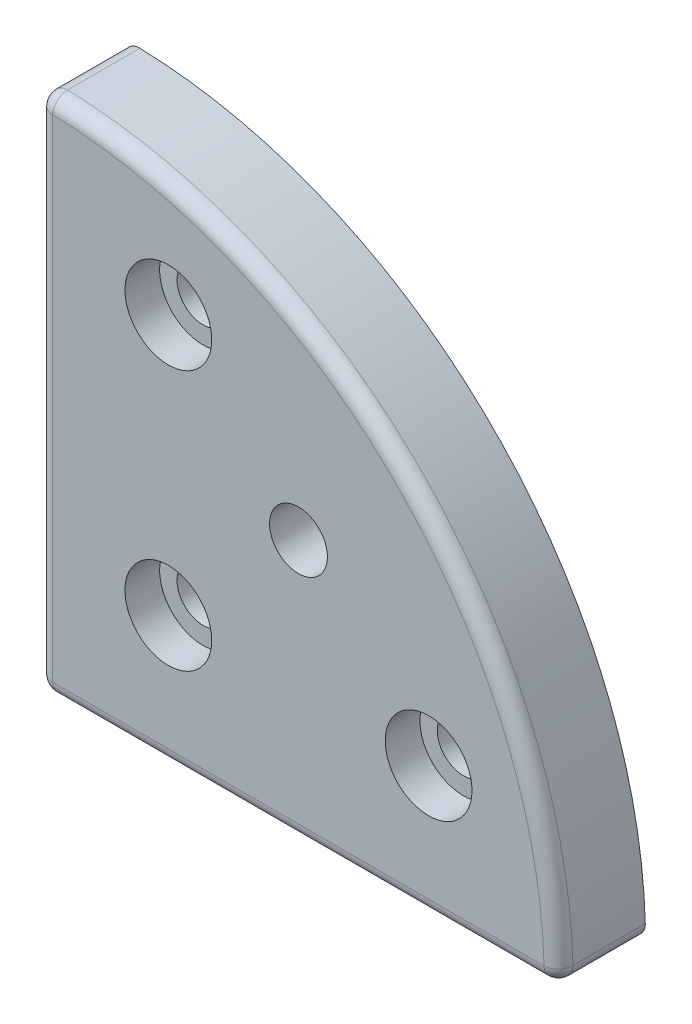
ISO-10303-21;
HEADER;
FILE_DESCRIPTION(('STEP AP214'),'2;1');
FILE_NAME('part.step','',(''),(''),'','','');
FILE_SCHEMA(('AUTOMOTIVE_DESIGN { 1 0 10303 214 1 1 1 1 }'));
ENDSEC;
DATA;
#1=APPLICATION_CONTEXT('core data for automotive mechanical design processes');
#2=APPLICATION_PROTOCOL_DEFINITION('international standard','automotive_design',2000,#1);
#3=PRODUCT_CONTEXT('',#1,'mechanical');
#4=PRODUCT('Part','Part','',(#3));
#5=PRODUCT_RELATED_PRODUCT_CATEGORY('part','',(#4));
#6=PRODUCT_DEFINITION_FORMATION('','',#4);
#7=PRODUCT_DEFINITION_CONTEXT('part definition',#1,'design');
#8=PRODUCT_DEFINITION('design','',#6,#7);
#9=PRODUCT_DEFINITION_SHAPE('','',#8);
#10=(LENGTH_UNIT() NAMED_UNIT(*) SI_UNIT(.MILLI.,.METRE.));
#11=(NAMED_UNIT(*) PLANE_ANGLE_UNIT() SI_UNIT($,.RADIAN.));
#12=(NAMED_UNIT(*) SI_UNIT($,.STERADIAN.) SOLID_ANGLE_UNIT());
#13=UNCERTAINTY_MEASURE_WITH_UNIT(LENGTH_MEASURE(1.E-05),#10,'distance_accuracy_value','');
#14=(GEOMETRIC_REPRESENTATION_CONTEXT(3) GLOBAL_UNCERTAINTY_ASSIGNED_CONTEXT((#13)) GLOBAL_UNIT_ASSIGNED_CONTEXT((#10,
#11,#12)) REPRESENTATION_CONTEXT('',''));
#15=CARTESIAN_POINT('',(0.,0.,0.));
#16=DIRECTION('',(0.,0.,1.));
#17=DIRECTION('',(1.,0.,0.));
#18=AXIS2_PLACEMENT_3D('',#15,#16,#17);
#19=CARTESIAN_POINT('',(65.9103992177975,51.8447142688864,9.));
#20=DIRECTION('',(0.,0.,1.));
#21=DIRECTION('',(1.,0.,0.));
#22=AXIS2_PLACEMENT_3D('',#19,#20,#21);
#23=CYLINDRICAL_SURFACE('',#22,7.5);
#24=CARTESIAN_POINT('',(65.9103992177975,51.8447142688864,9.));
#25=DIRECTION('',(0.,0.,1.));
#26=DIRECTION('',(1.,0.,0.));
#27=AXIS2_PLACEMENT_3D('',#24,#25,#26);
#28=CIRCLE('',#27,7.5);
#29=CARTESIAN_POINT('',(73.4103992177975,51.8447142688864,9.));
#30=VERTEX_POINT('',#29);
#31=EDGE_CURVE('E150',#30,#30,#28,.T.);
#32=ORIENTED_EDGE('',*,*,#31,.F.);
#33=EDGE_LOOP('',(#32));
#34=FACE_BOUND('',#33,.T.);
#35=CARTESIAN_POINT('',(65.9103992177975,51.8447142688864,15.));
#36=DIRECTION('',(0.,0.,1.));
#37=DIRECTION('',(1.,0.,0.));
#38=AXIS2_PLACEMENT_3D('',#35,#36,#37);
#39=CIRCLE('',#38,7.5);
#40=CARTESIAN_POINT('',(73.4103992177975,51.8447142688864,15.));
#41=VERTEX_POINT('',#40);
#42=EDGE_CURVE('E159',#41,#41,#39,.F.);
#43=ORIENTED_EDGE('',*,*,#42,.F.);
#44=EDGE_LOOP('',(#43));
#45=FACE_BOUND('',#44,.T.);
#46=ADVANCED_FACE('F15',(#34,#45),#23,.F.);
#47=CARTESIAN_POINT('',(20.9103992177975,51.8447142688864,9.));
#48=DIRECTION('',(0.,0.,1.));
#49=DIRECTION('',(1.,0.,0.));
#50=AXIS2_PLACEMENT_3D('',#47,#48,#49);
#51=CYLINDRICAL_SURFACE('',#50,7.5);
#52=CARTESIAN_POINT('',(20.9103992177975,51.8447142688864,9.));
#53=DIRECTION('',(0.,0.,1.));
#54=DIRECTION('',(1.,0.,0.));
#55=AXIS2_PLACEMENT_3D('',#52,#53,#54);
#56=CIRCLE('',#55,7.5);
#57=CARTESIAN_POINT('',(28.4103992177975,51.8447142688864,9.));
#58=VERTEX_POINT('',#57);
#59=EDGE_CURVE('E147',#58,#58,#56,.T.);
#60=ORIENTED_EDGE('',*,*,#59,.F.);
#61=EDGE_LOOP('',(#60));
#62=FACE_BOUND('',#61,.T.);
#63=CARTESIAN_POINT('',(20.9103992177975,51.8447142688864,15.));
#64=DIRECTION('',(0.,0.,1.));
#65=DIRECTION('',(1.,0.,0.));
#66=AXIS2_PLACEMENT_3D('',#63,#64,#65);
#67=CIRCLE('',#66,7.5);
#68=CARTESIAN_POINT('',(28.4103992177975,51.8447142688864,15.));
#69=VERTEX_POINT('',#68);
#70=EDGE_CURVE('E156',#69,#69,#67,.F.);
#71=ORIENTED_EDGE('',*,*,#70,.F.);
#72=EDGE_LOOP('',(#71));
#73=FACE_BOUND('',#72,.T.);
#74=ADVANCED_FACE('F432',(#62,#73),#51,.F.);
#75=CARTESIAN_POINT('',(20.9103992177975,96.8447142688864,9.));
#76=DIRECTION('',(0.,0.,1.));
#77=DIRECTION('',(1.,0.,0.));
#78=AXIS2_PLACEMENT_3D('',#75,#76,#77);
#79=CYLINDRICAL_SURFACE('',#78,7.5);
#80=CARTESIAN_POINT('',(20.9103992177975,96.8447142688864,9.));
#81=DIRECTION('',(0.,0.,1.));
#82=DIRECTION('',(1.,0.,0.));
#83=AXIS2_PLACEMENT_3D('',#80,#81,#82);
#84=CIRCLE('',#83,7.5);
#85=CARTESIAN_POINT('',(28.4103992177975,96.8447142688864,9.));
#86=VERTEX_POINT('',#85);
#87=EDGE_CURVE('E143',#86,#86,#84,.T.);
#88=ORIENTED_EDGE('',*,*,#87,.F.);
#89=EDGE_LOOP('',(#88));
#90=FACE_BOUND('',#89,.T.);
#91=CARTESIAN_POINT('',(20.9103992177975,96.8447142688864,15.));
#92=DIRECTION('',(0.,0.,1.));
#93=DIRECTION('',(1.,0.,0.));
#94=AXIS2_PLACEMENT_3D('',#91,#92,#93);
#95=CIRCLE('',#94,7.5);
#96=CARTESIAN_POINT('',(28.4103992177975,96.8447142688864,15.));
#97=VERTEX_POINT('',#96);
#98=EDGE_CURVE('E153',#97,#97,#95,.F.);
#99=ORIENTED_EDGE('',*,*,#98,.F.);
#100=EDGE_LOOP('',(#99));
#101=FACE_BOUND('',#100,.T.);
#102=ADVANCED_FACE('F426',(#90,#101),#79,.F.);
#103=CARTESIAN_POINT('',(0.910399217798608,49.292880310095,12.5));
#104=DIRECTION('',(0.,1.,0.));
#105=DIRECTION('',(-1.,0.,0.));
#106=AXIS2_PLACEMENT_3D('',#103,#104,#105);
#107=CYLINDRICAL_SURFACE('',#106,2.5);
#108=CARTESIAN_POINT('',(0.910399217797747,116.808992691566,12.5));
#109=DIRECTION('',(0.,1.,0.));
#110=DIRECTION('',(-1.,0.,0.));
#111=AXIS2_PLACEMENT_3D('',#108,#109,#110);
#112=CIRCLE('',#111,2.5);
#113=CARTESIAN_POINT('',(-1.58960078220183,116.808992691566,12.5));
#114=VERTEX_POINT('',#113);
#115=CARTESIAN_POINT('',(0.910399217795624,116.808992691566,15.));
#116=VERTEX_POINT('',#115);
#117=EDGE_CURVE('E71',#114,#116,#112,.T.);
#118=ORIENTED_EDGE('',*,*,#117,.F.);
#119=DIRECTION('',(0.,1.,0.));
#120=VECTOR('',#119,1.);
#121=CARTESIAN_POINT('',(-1.58960078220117,31.8447142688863,12.5));
#122=LINE('',#121,#120);
#123=CARTESIAN_POINT('',(-1.58960078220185,31.8447142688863,12.5));
#124=VERTEX_POINT('',#123);
#125=EDGE_CURVE('E146',#124,#114,#122,.T.);
#126=ORIENTED_EDGE('',*,*,#125,.F.);
#127=CARTESIAN_POINT('',(0.910399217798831,31.8447142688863,12.5));
#128=DIRECTION('',(0.,1.,0.));
#129=DIRECTION('',(-1.,0.,0.));
#130=AXIS2_PLACEMENT_3D('',#127,#128,#129);
#131=CIRCLE('',#130,2.5);
#132=CARTESIAN_POINT('',(0.910399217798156,31.8447142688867,15.));
#133=VERTEX_POINT('',#132);
#134=EDGE_CURVE('E18',#133,#124,#131,.F.);
#135=ORIENTED_EDGE('',*,*,#134,.F.);
#136=DIRECTION('',(0.,1.,0.));
#137=VECTOR('',#136,1.);
#138=CARTESIAN_POINT('',(0.910399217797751,66.741046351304,15.));
#139=LINE('',#138,#137);
#140=EDGE_CURVE('E162',#116,#133,#139,.F.);
#141=ORIENTED_EDGE('',*,*,#140,.F.);
#142=EDGE_LOOP('',(#118,#126,#135,#141));
#143=FACE_BOUND('',#142,.T.);
#144=ADVANCED_FACE('F186',(#143),#107,.T.);
#145=CARTESIAN_POINT('',(0.910399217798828,31.8447142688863,12.5));
#146=DIRECTION('',(-0.707106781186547,0.707106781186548,0.));
#147=DIRECTION('',(-0.707106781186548,-0.707106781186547,0.));
#148=AXIS2_PLACEMENT_3D('',#145,#146,#147);
#149=SPHERICAL_SURFACE('',#148,2.5);
#150=CARTESIAN_POINT('',(0.910399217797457,31.8447142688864,12.5));
#151=DIRECTION('',(0.,0.,1.));
#152=DIRECTION('',(1.,0.,0.));
#153=AXIS2_PLACEMENT_3D('',#150,#151,#152);
#154=CIRCLE('',#153,2.5);
#155=CARTESIAN_POINT('',(0.910399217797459,29.3447142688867,12.5));
#156=VERTEX_POINT('',#155);
#157=EDGE_CURVE('E183',#156,#124,#154,.F.);
#158=ORIENTED_EDGE('',*,*,#157,.F.);
#159=CARTESIAN_POINT('',(0.910399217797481,31.8447142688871,12.5));
#160=DIRECTION('',(-1.,0.,0.));
#161=DIRECTION('',(0.,-1.,0.));
#162=AXIS2_PLACEMENT_3D('',#159,#160,#161);
#163=CIRCLE('',#162,2.5);
#164=EDGE_CURVE('E177',#133,#156,#163,.F.);
#165=ORIENTED_EDGE('',*,*,#164,.F.);
#166=ORIENTED_EDGE('',*,*,#134,.T.);
#167=EDGE_LOOP('',(#158,#165,#166));
#168=FACE_BOUND('',#167,.T.);
#169=ADVANCED_FACE('F182',(#168),#149,.T.);
#170=CARTESIAN_POINT('',(60.8407044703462,31.8447142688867,12.5));
#171=DIRECTION('',(-1.,0.,0.));
#172=DIRECTION('',(0.,-1.,0.));
#173=AXIS2_PLACEMENT_3D('',#170,#171,#172);
#174=CYLINDRICAL_SURFACE('',#173,2.5);
#175=ORIENTED_EDGE('',*,*,#164,.T.);
#176=DIRECTION('',(1.,0.,0.));
#177=VECTOR('',#176,1.);
#178=CARTESIAN_POINT('',(85.8746776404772,29.3447142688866,12.5));
#179=LINE('',#178,#177);
#180=CARTESIAN_POINT('',(85.8746776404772,29.3447142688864,12.5));
#181=VERTEX_POINT('',#180);
#182=EDGE_CURVE('E97',#181,#156,#179,.F.);
#183=ORIENTED_EDGE('',*,*,#182,.F.);
#184=CARTESIAN_POINT('',(85.8746776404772,31.8447142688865,12.5));
#185=DIRECTION('',(-1.,0.,0.));
#186=DIRECTION('',(0.,-1.,0.));
#187=AXIS2_PLACEMENT_3D('',#184,#185,#186);
#188=CIRCLE('',#187,2.5);
#189=CARTESIAN_POINT('',(85.8746776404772,31.8447142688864,15.));
#190=VERTEX_POINT('',#189);
#191=EDGE_CURVE('E173',#190,#181,#188,.F.);
#192=ORIENTED_EDGE('',*,*,#191,.F.);
#193=DIRECTION('',(1.,0.,0.));
#194=VECTOR('',#193,1.);
#195=CARTESIAN_POINT('',(35.8067313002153,31.8447142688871,15.));
#196=LINE('',#195,#194);
#197=EDGE_CURVE('E164',#133,#190,#196,.T.);
#198=ORIENTED_EDGE('',*,*,#197,.F.);
#199=EDGE_LOOP('',(#175,#183,#192,#198));
#200=FACE_BOUND('',#199,.T.);
#201=ADVANCED_FACE('F240',(#200),#174,.T.);
#202=CARTESIAN_POINT('',(85.8746776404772,31.8447142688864,12.5));
#203=DIRECTION('',(-0.707106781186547,0.707106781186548,0.));
#204=DIRECTION('',(-0.707106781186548,-0.707106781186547,0.));
#205=AXIS2_PLACEMENT_3D('',#202,#203,#204);
#206=SPHERICAL_SURFACE('',#205,2.5);
#207=CARTESIAN_POINT('',(85.8746776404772,31.8447142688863,12.5));
#208=DIRECTION('',(0.,0.,1.));
#209=DIRECTION('',(1.,0.,0.));
#210=AXIS2_PLACEMENT_3D('',#207,#208,#209);
#211=CIRCLE('',#210,2.5);
#212=CARTESIAN_POINT('',(88.3736570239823,31.916142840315,12.5));
#213=VERTEX_POINT('',#212);
#214=CARTESIAN_POINT('',(87.6424445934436,30.07694731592,12.5));
#215=VERTEX_POINT('',#214);
#216=EDGE_CURVE('E33',#213,#215,#211,.F.);
#217=ORIENTED_EDGE('',*,*,#216,.F.);
#218=CARTESIAN_POINT('',(85.8746776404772,31.8447142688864,12.5));
#219=DIRECTION('',(0.0285714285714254,-0.999591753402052,0.));
#220=DIRECTION('',(0.999591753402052,0.0285714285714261,0.));
#221=AXIS2_PLACEMENT_3D('',#218,#219,#220);
#222=CIRCLE('',#221,2.5);
#223=EDGE_CURVE('E169',#190,#213,#222,.F.);
#224=ORIENTED_EDGE('',*,*,#223,.F.);
#225=ORIENTED_EDGE('',*,*,#191,.T.);
#226=CARTESIAN_POINT('',(85.8746776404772,31.8447142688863,12.5));
#227=DIRECTION('',(0.,0.,1.));
#228=DIRECTION('',(1.,0.,0.));
#229=AXIS2_PLACEMENT_3D('',#226,#227,#228);
#230=CIRCLE('',#229,2.5);
#231=EDGE_CURVE('E140',#215,#181,#230,.F.);
#232=ORIENTED_EDGE('',*,*,#231,.F.);
#233=EDGE_LOOP('',(#217,#224,#225,#232));
#234=FACE_BOUND('',#233,.T.);
#235=ADVANCED_FACE('F237',(#234),#206,.T.);
#236=CARTESIAN_POINT('',(-1.58960078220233,29.3447142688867,12.5));
#237=DIRECTION('',(0.,0.,-1.));
#238=DIRECTION('',(0.707106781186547,-0.707106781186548,0.));
#239=AXIS2_PLACEMENT_3D('',#236,#237,#238);
#240=TOROIDAL_SURFACE('',#239,87.5,2.5);
#241=ORIENTED_EDGE('',*,*,#223,.T.);
#242=CARTESIAN_POINT('',(-1.58960078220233,29.3447142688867,12.5));
#243=DIRECTION('',(0.,0.,1.));
#244=DIRECTION('',(1.,0.,0.));
#245=AXIS2_PLACEMENT_3D('',#242,#243,#244);
#246=CIRCLE('',#245,90.);
#247=CARTESIAN_POINT('',(0.981827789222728,119.307972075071,12.5));
#248=VERTEX_POINT('',#247);
#249=EDGE_CURVE('E231',#248,#213,#246,.F.);
#250=ORIENTED_EDGE('',*,*,#249,.F.);
#251=CARTESIAN_POINT('',(0.910399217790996,116.808992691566,12.5));
#252=DIRECTION('',(0.999591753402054,-0.0285714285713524,0.));
#253=DIRECTION('',(0.0285714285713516,0.999591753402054,0.));
#254=AXIS2_PLACEMENT_3D('',#251,#252,#253);
#255=CIRCLE('',#254,2.5);
#256=EDGE_CURVE('E165',#116,#248,#255,.F.);
#257=ORIENTED_EDGE('',*,*,#256,.F.);
#258=CARTESIAN_POINT('',(-1.58960078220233,29.3447142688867,15.));
#259=DIRECTION('',(0.,0.,-1.));
#260=DIRECTION('',(0.0285714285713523,0.999591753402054,0.));
#261=AXIS2_PLACEMENT_3D('',#258,#259,#260);
#262=CIRCLE('',#261,87.4999999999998);
#263=EDGE_CURVE('E200',#190,#116,#262,.F.);
#264=ORIENTED_EDGE('',*,*,#263,.F.);
#265=EDGE_LOOP('',(#241,#250,#257,#264));
#266=FACE_BOUND('',#265,.T.);
#267=ADVANCED_FACE('F224',(#266),#240,.T.);
#268=CARTESIAN_POINT('',(0.910399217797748,116.808992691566,12.5));
#269=DIRECTION('',(-0.707106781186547,0.707106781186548,0.));
#270=DIRECTION('',(-0.707106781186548,-0.707106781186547,0.));
#271=AXIS2_PLACEMENT_3D('',#268,#269,#270);
#272=SPHERICAL_SURFACE('',#271,2.5);
#273=CARTESIAN_POINT('',(0.910399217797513,116.808992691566,12.5));
#274=DIRECTION('',(0.,0.,1.));
#275=DIRECTION('',(1.,0.,0.));
#276=AXIS2_PLACEMENT_3D('',#273,#274,#275);
#277=CIRCLE('',#276,2.5);
#278=CARTESIAN_POINT('',(-0.857367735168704,118.576759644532,12.5));
#279=VERTEX_POINT('',#278);
#280=EDGE_CURVE('E139',#114,#279,#277,.F.);
#281=ORIENTED_EDGE('',*,*,#280,.F.);
#282=ORIENTED_EDGE('',*,*,#117,.T.);
#283=ORIENTED_EDGE('',*,*,#256,.T.);
#284=CARTESIAN_POINT('',(0.910399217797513,116.808992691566,12.5));
#285=DIRECTION('',(0.,0.,1.));
#286=DIRECTION('',(1.,0.,0.));
#287=AXIS2_PLACEMENT_3D('',#284,#285,#286);
#288=CIRCLE('',#287,2.5);
#289=EDGE_CURVE('E135',#279,#248,#288,.F.);
#290=ORIENTED_EDGE('',*,*,#289,.F.);
#291=EDGE_LOOP('',(#281,#282,#283,#290));
#292=FACE_BOUND('',#291,.T.);
#293=ADVANCED_FACE('F218',(#292),#272,.T.);
#294=CARTESIAN_POINT('',(35.8067313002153,66.741046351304,15.));
#295=DIRECTION('',(0.,0.,1.));
#296=DIRECTION('',(1.,0.,0.));
#297=AXIS2_PLACEMENT_3D('',#294,#295,#296);
#298=PLANE('',#297);
#299=ORIENTED_EDGE('',*,*,#98,.T.);
#300=EDGE_LOOP('',(#299));
#301=FACE_BOUND('',#300,.T.);
#302=ORIENTED_EDGE('',*,*,#70,.T.);
#303=EDGE_LOOP('',(#302));
#304=FACE_BOUND('',#303,.T.);
#305=ORIENTED_EDGE('',*,*,#42,.T.);
#306=EDGE_LOOP('',(#305));
#307=FACE_BOUND('',#306,.T.);
#308=CARTESIAN_POINT('',(43.4103992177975,74.3447142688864,15.));
#309=DIRECTION('',(0.,0.,1.));
#310=DIRECTION('',(1.,0.,0.));
#311=AXIS2_PLACEMENT_3D('',#308,#309,#310);
#312=CIRCLE('',#311,5.);
#313=CARTESIAN_POINT('',(48.4103992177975,74.3447142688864,15.));
#314=VERTEX_POINT('',#313);
#315=EDGE_CURVE('E131',#314,#314,#312,.F.);
#316=ORIENTED_EDGE('',*,*,#315,.T.);
#317=EDGE_LOOP('',(#316));
#318=FACE_BOUND('',#317,.T.);
#319=ORIENTED_EDGE('',*,*,#263,.T.);
#320=ORIENTED_EDGE('',*,*,#140,.T.);
#321=ORIENTED_EDGE('',*,*,#197,.T.);
#322=EDGE_LOOP('',(#319,#320,#321));
#323=FACE_BOUND('',#322,.T.);
#324=ADVANCED_FACE('F207',(#301,#304,#307,#318,#323),#298,.T.);
#325=CARTESIAN_POINT('',(65.9103992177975,51.8447142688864,9.));
#326=DIRECTION('',(0.,0.,1.));
#327=DIRECTION('',(1.,0.,0.));
#328=AXIS2_PLACEMENT_3D('',#325,#326,#327);
#329=PLANE('',#328);
#330=CARTESIAN_POINT('',(65.9103992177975,51.8447142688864,9.));
#331=DIRECTION('',(0.,0.,1.));
#332=DIRECTION('',(1.,0.,0.));
#333=AXIS2_PLACEMENT_3D('',#330,#331,#332);
#334=CIRCLE('',#333,4.5);
#335=CARTESIAN_POINT('',(70.4103992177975,51.8447142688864,9.));
#336=VERTEX_POINT('',#335);
#337=EDGE_CURVE('E128',#336,#336,#334,.F.);
#338=ORIENTED_EDGE('',*,*,#337,.T.);
#339=EDGE_LOOP('',(#338));
#340=FACE_BOUND('',#339,.T.);
#341=ORIENTED_EDGE('',*,*,#31,.T.);
#342=EDGE_LOOP('',(#341));
#343=FACE_BOUND('',#342,.T.);
#344=ADVANCED_FACE('F217',(#340,#343),#329,.T.);
#345=CARTESIAN_POINT('',(20.9103992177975,51.8447142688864,9.));
#346=DIRECTION('',(0.,0.,1.));
#347=DIRECTION('',(1.,0.,0.));
#348=AXIS2_PLACEMENT_3D('',#345,#346,#347);
#349=PLANE('',#348);
#350=CARTESIAN_POINT('',(20.9103992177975,51.8447142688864,9.));
#351=DIRECTION('',(0.,0.,1.));
#352=DIRECTION('',(1.,0.,0.));
#353=AXIS2_PLACEMENT_3D('',#350,#351,#352);
#354=CIRCLE('',#353,4.5);
#355=CARTESIAN_POINT('',(25.4103992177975,51.8447142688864,9.));
#356=VERTEX_POINT('',#355);
#357=EDGE_CURVE('E125',#356,#356,#354,.F.);
#358=ORIENTED_EDGE('',*,*,#357,.T.);
#359=EDGE_LOOP('',(#358));
#360=FACE_BOUND('',#359,.T.);
#361=ORIENTED_EDGE('',*,*,#59,.T.);
#362=EDGE_LOOP('',(#361));
#363=FACE_BOUND('',#362,.T.);
#364=ADVANCED_FACE('F381',(#360,#363),#349,.T.);
#365=CARTESIAN_POINT('',(20.9103992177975,96.8447142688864,9.));
#366=DIRECTION('',(0.,0.,1.));
#367=DIRECTION('',(1.,0.,0.));
#368=AXIS2_PLACEMENT_3D('',#365,#366,#367);
#369=PLANE('',#368);
#370=CARTESIAN_POINT('',(20.9103992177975,96.8447142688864,9.));
#371=DIRECTION('',(0.,0.,1.));
#372=DIRECTION('',(1.,0.,0.));
#373=AXIS2_PLACEMENT_3D('',#370,#371,#372);
#374=CIRCLE('',#373,4.5);
#375=CARTESIAN_POINT('',(25.4103992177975,96.8447142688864,9.));
#376=VERTEX_POINT('',#375);
#377=EDGE_CURVE('E118',#376,#376,#374,.F.);
#378=ORIENTED_EDGE('',*,*,#377,.T.);
#379=EDGE_LOOP('',(#378));
#380=FACE_BOUND('',#379,.T.);
#381=ORIENTED_EDGE('',*,*,#87,.T.);
#382=EDGE_LOOP('',(#381));
#383=FACE_BOUND('',#382,.T.);
#384=ADVANCED_FACE('F374',(#380,#383),#369,.T.);
#385=CARTESIAN_POINT('',(-1.58960078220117,31.8447142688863,0.));
#386=DIRECTION('',(-1.,0.,0.));
#387=DIRECTION('',(0.,0.,1.));
#388=AXIS2_PLACEMENT_3D('',#385,#386,#387);
#389=PLANE('',#388);
#390=DIRECTION('',(0.,1.,0.));
#391=VECTOR('',#390,1.);
#392=CARTESIAN_POINT('',(-1.58960078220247,66.741046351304,0.));
#393=LINE('',#392,#391);
#394=CARTESIAN_POINT('',(-1.58960078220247,116.808992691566,0.));
#395=VERTEX_POINT('',#394);
#396=CARTESIAN_POINT('',(-1.5896007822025,31.8447142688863,0.));
#397=VERTEX_POINT('',#396);
#398=EDGE_CURVE('E116',#395,#397,#393,.F.);
#399=ORIENTED_EDGE('',*,*,#398,.T.);
#400=DIRECTION('',(0.,0.,1.));
#401=VECTOR('',#400,1.);
#402=CARTESIAN_POINT('',(-1.58960078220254,31.8447142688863,0.));
#403=LINE('',#402,#401);
#404=EDGE_CURVE('E115',#124,#397,#403,.F.);
#405=ORIENTED_EDGE('',*,*,#404,.F.);
#406=ORIENTED_EDGE('',*,*,#125,.T.);
#407=DIRECTION('',(0.,0.,1.));
#408=VECTOR('',#407,1.);
#409=CARTESIAN_POINT('',(-1.58960078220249,116.808992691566,0.));
#410=LINE('',#409,#408);
#411=EDGE_CURVE('E134',#395,#114,#410,.T.);
#412=ORIENTED_EDGE('',*,*,#411,.F.);
#413=EDGE_LOOP('',(#399,#405,#406,#412));
#414=FACE_BOUND('',#413,.T.);
#415=ADVANCED_FACE('F190',(#414),#389,.T.);
#416=CARTESIAN_POINT('',(0.910399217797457,31.8447142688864,0.));
#417=DIRECTION('',(0.,0.,1.));
#418=DIRECTION('',(1.,0.,0.));
#419=AXIS2_PLACEMENT_3D('',#416,#417,#418);
#420=CYLINDRICAL_SURFACE('',#419,2.5);
#421=CARTESIAN_POINT('',(0.910399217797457,31.8447142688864,0.));
#422=DIRECTION('',(0.,0.,1.));
#423=DIRECTION('',(1.,0.,0.));
#424=AXIS2_PLACEMENT_3D('',#421,#422,#423);
#425=CIRCLE('',#424,2.5);
#426=CARTESIAN_POINT('',(0.910399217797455,29.3447142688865,0.));
#427=VERTEX_POINT('',#426);
#428=EDGE_CURVE('E108',#397,#427,#425,.T.);
#429=ORIENTED_EDGE('',*,*,#428,.T.);
#430=DIRECTION('',(0.,0.,-1.));
#431=VECTOR('',#430,1.);
#432=CARTESIAN_POINT('',(0.910399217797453,29.3447142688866,0.));
#433=LINE('',#432,#431);
#434=EDGE_CURVE('E91',#156,#427,#433,.T.);
#435=ORIENTED_EDGE('',*,*,#434,.F.);
#436=ORIENTED_EDGE('',*,*,#157,.T.);
#437=ORIENTED_EDGE('',*,*,#404,.T.);
#438=EDGE_LOOP('',(#429,#435,#436,#437));
#439=FACE_BOUND('',#438,.T.);
#440=ADVANCED_FACE('F113',(#439),#420,.T.);
#441=CARTESIAN_POINT('',(85.8746776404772,29.3447142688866,0.));
#442=DIRECTION('',(0.,-1.,0.));
#443=DIRECTION('',(0.,0.,-1.));
#444=AXIS2_PLACEMENT_3D('',#441,#442,#443);
#445=PLANE('',#444);
#446=DIRECTION('',(1.,0.,0.));
#447=VECTOR('',#446,1.);
#448=CARTESIAN_POINT('',(35.8067313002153,29.3447142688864,0.));
#449=LINE('',#448,#447);
#450=CARTESIAN_POINT('',(85.8746776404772,29.3447142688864,0.));
#451=VERTEX_POINT('',#450);
#452=EDGE_CURVE('E95',#427,#451,#449,.T.);
#453=ORIENTED_EDGE('',*,*,#452,.T.);
#454=DIRECTION('',(0.,0.,1.));
#455=VECTOR('',#454,1.);
#456=CARTESIAN_POINT('',(85.8746776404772,29.3447142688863,0.));
#457=LINE('',#456,#455);
#458=EDGE_CURVE('E142',#181,#451,#457,.F.);
#459=ORIENTED_EDGE('',*,*,#458,.F.);
#460=ORIENTED_EDGE('',*,*,#182,.T.);
#461=ORIENTED_EDGE('',*,*,#434,.T.);
#462=EDGE_LOOP('',(#453,#459,#460,#461));
#463=FACE_BOUND('',#462,.T.);
#464=ADVANCED_FACE('F93',(#463),#445,.T.);
#465=CARTESIAN_POINT('',(85.8746776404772,31.8447142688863,0.));
#466=DIRECTION('',(0.,0.,1.));
#467=DIRECTION('',(1.,0.,0.));
#468=AXIS2_PLACEMENT_3D('',#465,#466,#467);
#469=CYLINDRICAL_SURFACE('',#468,2.5);
#470=CARTESIAN_POINT('',(85.8746776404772,31.8447142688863,0.));
#471=DIRECTION('',(0.,0.,1.));
#472=DIRECTION('',(1.,0.,0.));
#473=AXIS2_PLACEMENT_3D('',#470,#471,#472);
#474=CIRCLE('',#473,2.5);
#475=CARTESIAN_POINT('',(88.3736570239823,31.916142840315,0.));
#476=VERTEX_POINT('',#475);
#477=EDGE_CURVE('E111',#451,#476,#474,.T.);
#478=ORIENTED_EDGE('',*,*,#477,.T.);
#479=DIRECTION('',(0.,0.,1.));
#480=VECTOR('',#479,1.);
#481=CARTESIAN_POINT('',(88.3736570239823,31.916142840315,0.));
#482=LINE('',#481,#480);
#483=EDGE_CURVE('E274',#213,#476,#482,.F.);
#484=ORIENTED_EDGE('',*,*,#483,.F.);
#485=ORIENTED_EDGE('',*,*,#216,.T.);
#486=ORIENTED_EDGE('',*,*,#231,.T.);
#487=ORIENTED_EDGE('',*,*,#458,.T.);
#488=EDGE_LOOP('',(#478,#484,#485,#486,#487));
#489=FACE_BOUND('',#488,.T.);
#490=ADVANCED_FACE('F273',(#489),#469,.T.);
#491=CARTESIAN_POINT('',(-1.58960078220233,29.3447142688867,0.));
#492=DIRECTION('',(0.,0.,1.));
#493=DIRECTION('',(1.,0.,0.));
#494=AXIS2_PLACEMENT_3D('',#491,#492,#493);
#495=CYLINDRICAL_SURFACE('',#494,90.);
#496=CARTESIAN_POINT('',(-1.58960078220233,29.3447142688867,0.));
#497=DIRECTION('',(0.,0.,1.));
#498=DIRECTION('',(1.,0.,0.));
#499=AXIS2_PLACEMENT_3D('',#496,#497,#498);
#500=CIRCLE('',#499,90.);
#501=CARTESIAN_POINT('',(0.981827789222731,119.307972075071,0.));
#502=VERTEX_POINT('',#501);
#503=EDGE_CURVE('E269',#476,#502,#500,.T.);
#504=ORIENTED_EDGE('',*,*,#503,.T.);
#505=DIRECTION('',(0.,0.,1.));
#506=VECTOR('',#505,1.);
#507=CARTESIAN_POINT('',(0.981827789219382,119.307972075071,0.));
#508=LINE('',#507,#506);
#509=EDGE_CURVE('E138',#248,#502,#508,.F.);
#510=ORIENTED_EDGE('',*,*,#509,.F.);
#511=ORIENTED_EDGE('',*,*,#249,.T.);
#512=ORIENTED_EDGE('',*,*,#483,.T.);
#513=EDGE_LOOP('',(#504,#510,#511,#512));
#514=FACE_BOUND('',#513,.T.);
#515=ADVANCED_FACE('F286',(#514),#495,.T.);
#516=CARTESIAN_POINT('',(0.910399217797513,116.808992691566,0.));
#517=DIRECTION('',(0.,0.,1.));
#518=DIRECTION('',(1.,0.,0.));
#519=AXIS2_PLACEMENT_3D('',#516,#517,#518);
#520=CYLINDRICAL_SURFACE('',#519,2.5);
#521=CARTESIAN_POINT('',(0.910399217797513,116.808992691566,0.));
#522=DIRECTION('',(0.,0.,1.));
#523=DIRECTION('',(1.,0.,0.));
#524=AXIS2_PLACEMENT_3D('',#521,#522,#523);
#525=CIRCLE('',#524,2.5);
#526=EDGE_CURVE('E267',#502,#395,#525,.T.);
#527=ORIENTED_EDGE('',*,*,#526,.T.);
#528=ORIENTED_EDGE('',*,*,#411,.T.);
#529=ORIENTED_EDGE('',*,*,#280,.T.);
#530=ORIENTED_EDGE('',*,*,#289,.T.);
#531=ORIENTED_EDGE('',*,*,#509,.T.);
#532=EDGE_LOOP('',(#527,#528,#529,#530,#531));
#533=FACE_BOUND('',#532,.T.);
#534=ADVANCED_FACE('F282',(#533),#520,.T.);
#535=CARTESIAN_POINT('',(43.4103992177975,74.3447142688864,0.));
#536=DIRECTION('',(0.,0.,1.));
#537=DIRECTION('',(1.,0.,0.));
#538=AXIS2_PLACEMENT_3D('',#535,#536,#537);
#539=CYLINDRICAL_SURFACE('',#538,5.);
#540=CARTESIAN_POINT('',(43.4103992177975,74.3447142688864,0.));
#541=DIRECTION('',(0.,0.,1.));
#542=DIRECTION('',(1.,0.,0.));
#543=AXIS2_PLACEMENT_3D('',#540,#541,#542);
#544=CIRCLE('',#543,5.);
#545=CARTESIAN_POINT('',(48.4103992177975,74.3447142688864,0.));
#546=VERTEX_POINT('',#545);
#547=EDGE_CURVE('E264',#546,#546,#544,.F.);
#548=ORIENTED_EDGE('',*,*,#547,.T.);
#549=EDGE_LOOP('',(#548));
#550=FACE_BOUND('',#549,.T.);
#551=ORIENTED_EDGE('',*,*,#315,.F.);
#552=EDGE_LOOP('',(#551));
#553=FACE_BOUND('',#552,.T.);
#554=ADVANCED_FACE('F294',(#550,#553),#539,.F.);
#555=CARTESIAN_POINT('',(65.9103992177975,51.8447142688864,0.));
#556=DIRECTION('',(0.,0.,1.));
#557=DIRECTION('',(1.,0.,0.));
#558=AXIS2_PLACEMENT_3D('',#555,#556,#557);
#559=CYLINDRICAL_SURFACE('',#558,4.5);
#560=CARTESIAN_POINT('',(65.9103992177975,51.8447142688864,0.));
#561=DIRECTION('',(0.,0.,1.));
#562=DIRECTION('',(1.,0.,0.));
#563=AXIS2_PLACEMENT_3D('',#560,#561,#562);
#564=CIRCLE('',#563,4.5);
#565=CARTESIAN_POINT('',(70.4103992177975,51.8447142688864,0.));
#566=VERTEX_POINT('',#565);
#567=EDGE_CURVE('E261',#566,#566,#564,.F.);
#568=ORIENTED_EDGE('',*,*,#567,.T.);
#569=EDGE_LOOP('',(#568));
#570=FACE_BOUND('',#569,.T.);
#571=ORIENTED_EDGE('',*,*,#337,.F.);
#572=EDGE_LOOP('',(#571));
#573=FACE_BOUND('',#572,.T.);
#574=ADVANCED_FACE('F312',(#570,#573),#559,.F.);
#575=CARTESIAN_POINT('',(20.9103992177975,51.8447142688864,0.));
#576=DIRECTION('',(0.,0.,1.));
#577=DIRECTION('',(1.,0.,0.));
#578=AXIS2_PLACEMENT_3D('',#575,#576,#577);
#579=CYLINDRICAL_SURFACE('',#578,4.5);
#580=CARTESIAN_POINT('',(20.9103992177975,51.8447142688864,0.));
#581=DIRECTION('',(0.,0.,1.));
#582=DIRECTION('',(1.,0.,0.));
#583=AXIS2_PLACEMENT_3D('',#580,#581,#582);
#584=CIRCLE('',#583,4.5);
#585=CARTESIAN_POINT('',(25.4103992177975,51.8447142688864,0.));
#586=VERTEX_POINT('',#585);
#587=EDGE_CURVE('E24',#586,#586,#584,.F.);
#588=ORIENTED_EDGE('',*,*,#587,.T.);
#589=EDGE_LOOP('',(#588));
#590=FACE_BOUND('',#589,.T.);
#591=ORIENTED_EDGE('',*,*,#357,.F.);
#592=EDGE_LOOP('',(#591));
#593=FACE_BOUND('',#592,.T.);
#594=ADVANCED_FACE('F304',(#590,#593),#579,.F.);
#595=CARTESIAN_POINT('',(20.9103992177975,96.8447142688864,0.));
#596=DIRECTION('',(0.,0.,1.));
#597=DIRECTION('',(1.,0.,0.));
#598=AXIS2_PLACEMENT_3D('',#595,#596,#597);
#599=CYLINDRICAL_SURFACE('',#598,4.5);
#600=CARTESIAN_POINT('',(20.9103992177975,96.8447142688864,0.));
#601=DIRECTION('',(0.,0.,1.));
#602=DIRECTION('',(1.,0.,0.));
#603=AXIS2_PLACEMENT_3D('',#600,#601,#602);
#604=CIRCLE('',#603,4.5);
#605=CARTESIAN_POINT('',(25.4103992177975,96.8447142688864,0.));
#606=VERTEX_POINT('',#605);
#607=EDGE_CURVE('E10',#606,#606,#604,.F.);
#608=ORIENTED_EDGE('',*,*,#607,.T.);
#609=EDGE_LOOP('',(#608));
#610=FACE_BOUND('',#609,.T.);
#611=ORIENTED_EDGE('',*,*,#377,.F.);
#612=EDGE_LOOP('',(#611));
#613=FACE_BOUND('',#612,.T.);
#614=ADVANCED_FACE('F298',(#610,#613),#599,.F.);
#615=CARTESIAN_POINT('',(35.8067313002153,66.741046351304,0.));
#616=DIRECTION('',(0.,0.,1.));
#617=DIRECTION('',(1.,0.,0.));
#618=AXIS2_PLACEMENT_3D('',#615,#616,#617);
#619=PLANE('',#618);
#620=ORIENTED_EDGE('',*,*,#607,.F.);
#621=EDGE_LOOP('',(#620));
#622=FACE_BOUND('',#621,.T.);
#623=ORIENTED_EDGE('',*,*,#587,.F.);
#624=EDGE_LOOP('',(#623));
#625=FACE_BOUND('',#624,.T.);
#626=ORIENTED_EDGE('',*,*,#567,.F.);
#627=EDGE_LOOP('',(#626));
#628=FACE_BOUND('',#627,.T.);
#629=ORIENTED_EDGE('',*,*,#547,.F.);
#630=EDGE_LOOP('',(#629));
#631=FACE_BOUND('',#630,.T.);
#632=ORIENTED_EDGE('',*,*,#503,.F.);
#633=ORIENTED_EDGE('',*,*,#477,.F.);
#634=ORIENTED_EDGE('',*,*,#452,.F.);
#635=ORIENTED_EDGE('',*,*,#428,.F.);
#636=ORIENTED_EDGE('',*,*,#398,.F.);
#637=ORIENTED_EDGE('',*,*,#526,.F.);
#638=EDGE_LOOP('',(#632,#633,#634,#635,#636,#637));
#639=FACE_BOUND('',#638,.T.);
#640=ADVANCED_FACE('F107',(#622,#625,#628,#631,#639),#619,.F.);
#641=CLOSED_SHELL('',(#46,#74,#102,#144,#169,#201,#235,#267,#293,#324,#344,#364,#384,#415,#440,
#464,#490,#515,#534,#554,#574,#594,#614,#640));
#642=MANIFOLD_SOLID_BREP('B1',#641);
#643=ADVANCED_BREP_SHAPE_REPRESENTATION('',(#18,#642),#14);
#644=SHAPE_DEFINITION_REPRESENTATION(#9,#643);
ENDSEC;
END-ISO-10303-21;
